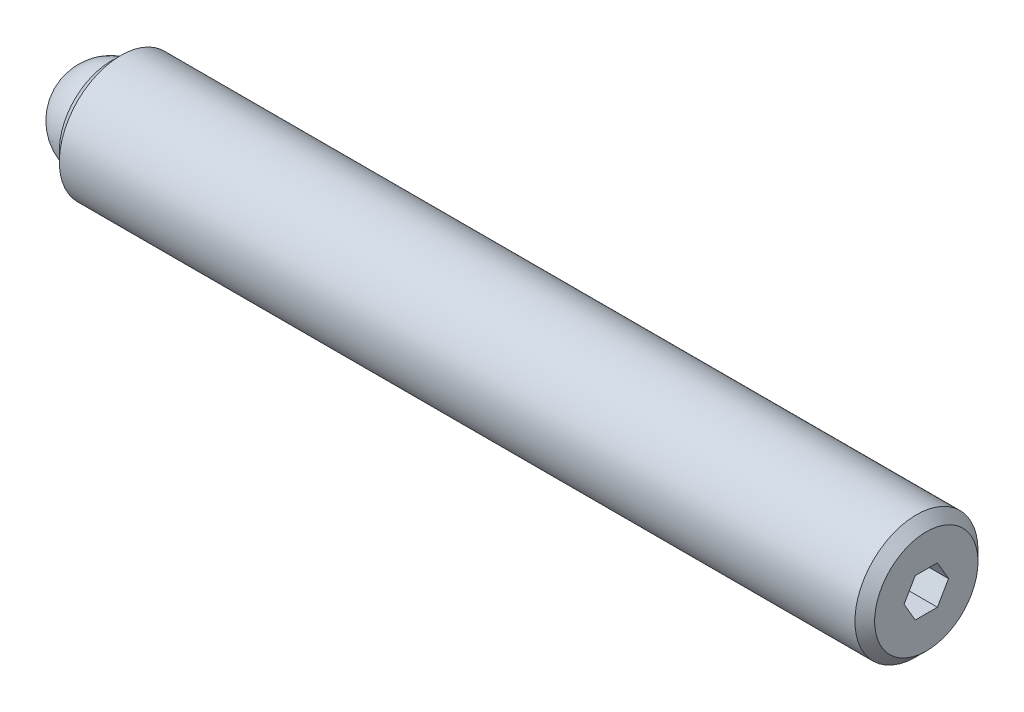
ISO-10303-21;
HEADER;
FILE_DESCRIPTION(('STEP AP214'),'2;1');
FILE_NAME('part.step','',(''),(''),'','','');
FILE_SCHEMA(('AUTOMOTIVE_DESIGN { 1 0 10303 214 1 1 1 1 }'));
ENDSEC;
DATA;
#1=APPLICATION_CONTEXT('core data for automotive mechanical design processes');
#2=APPLICATION_PROTOCOL_DEFINITION('international standard','automotive_design',2000,#1);
#3=PRODUCT_CONTEXT('',#1,'mechanical');
#4=PRODUCT('Part','Part','',(#3));
#5=PRODUCT_RELATED_PRODUCT_CATEGORY('part','',(#4));
#6=PRODUCT_DEFINITION_FORMATION('','',#4);
#7=PRODUCT_DEFINITION_CONTEXT('part definition',#1,'design');
#8=PRODUCT_DEFINITION('design','',#6,#7);
#9=PRODUCT_DEFINITION_SHAPE('','',#8);
#10=(LENGTH_UNIT() NAMED_UNIT(*) SI_UNIT(.MILLI.,.METRE.));
#11=(NAMED_UNIT(*) PLANE_ANGLE_UNIT() SI_UNIT($,.RADIAN.));
#12=(NAMED_UNIT(*) SI_UNIT($,.STERADIAN.) SOLID_ANGLE_UNIT());
#13=UNCERTAINTY_MEASURE_WITH_UNIT(LENGTH_MEASURE(1.E-05),#10,'distance_accuracy_value','');
#14=(GEOMETRIC_REPRESENTATION_CONTEXT(3) GLOBAL_UNCERTAINTY_ASSIGNED_CONTEXT((#13)) GLOBAL_UNIT_ASSIGNED_CONTEXT((#10,
#11,#12)) REPRESENTATION_CONTEXT('',''));
#15=CARTESIAN_POINT('',(0.,0.,0.));
#16=DIRECTION('',(0.,0.,1.));
#17=DIRECTION('',(1.,0.,0.));
#18=AXIS2_PLACEMENT_3D('',#15,#16,#17);
#19=CARTESIAN_POINT('',(0.,0.,0.));
#20=DIRECTION('',(0.,-1.,0.));
#21=DIRECTION('',(0.,0.,1.));
#22=AXIS2_PLACEMENT_3D('',#19,#20,#21);
#23=SPHERICAL_SURFACE('',#22,2.38125);
#24=CARTESIAN_POINT('',(0.,-2.38125,0.));
#25=VERTEX_POINT('',#24);
#26=VERTEX_LOOP('',#25);
#27=FACE_BOUND('',#26,.T.);
#28=ADVANCED_FACE('F41',(#27),#23,.T.);
#29=CLOSED_SHELL('',(#28));
#30=MANIFOLD_SOLID_BREP('B2',#29);
#31=CARTESIAN_POINT('',(42.06875,0.,0.));
#32=DIRECTION('',(-1.,0.,0.));
#33=DIRECTION('',(0.,0.,1.));
#34=AXIS2_PLACEMENT_3D('',#31,#32,#33);
#35=CYLINDRICAL_SURFACE('',#34,3.175);
#36=CARTESIAN_POINT('',(41.56075,0.,0.));
#37=DIRECTION('',(1.,0.,0.));
#38=DIRECTION('',(0.,0.,-1.));
#39=AXIS2_PLACEMENT_3D('',#36,#37,#38);
#40=CIRCLE('',#39,3.175);
#41=CARTESIAN_POINT('',(41.56075,0.,-3.175));
#42=VERTEX_POINT('',#41);
#43=EDGE_CURVE('E39',#42,#42,#40,.F.);
#44=ORIENTED_EDGE('',*,*,#43,.T.);
#45=EDGE_LOOP('',(#44));
#46=FACE_BOUND('',#45,.T.);
#47=CARTESIAN_POINT('',(0.508000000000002,0.,0.));
#48=DIRECTION('',(1.,0.,0.));
#49=DIRECTION('',(0.,0.,-1.));
#50=AXIS2_PLACEMENT_3D('',#47,#48,#49);
#51=CIRCLE('',#50,3.175);
#52=CARTESIAN_POINT('',(0.508000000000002,0.,-3.175));
#53=VERTEX_POINT('',#52);
#54=EDGE_CURVE('E176',#53,#53,#51,.T.);
#55=ORIENTED_EDGE('',*,*,#54,.T.);
#56=EDGE_LOOP('',(#55));
#57=FACE_BOUND('',#56,.T.);
#58=ADVANCED_FACE('F54',(#46,#57),#35,.T.);
#59=CARTESIAN_POINT('',(42.06875,0.,0.));
#60=DIRECTION('',(1.,0.,0.));
#61=DIRECTION('',(0.,0.,-1.));
#62=AXIS2_PLACEMENT_3D('',#59,#60,#61);
#63=PLANE('',#62);
#64=DIRECTION('',(0.,0.866025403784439,-0.5));
#65=VECTOR('',#64,1.);
#66=CARTESIAN_POINT('',(42.06875,-0.9921875,-0.572839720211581));
#67=LINE('',#66,#65);
#68=CARTESIAN_POINT('',(42.06875,-0.9921875,-0.572839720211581));
#69=VERTEX_POINT('',#68);
#70=CARTESIAN_POINT('',(42.06875,0.,-1.14567944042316));
#71=VERTEX_POINT('',#70);
#72=EDGE_CURVE('E77',#69,#71,#67,.T.);
#73=ORIENTED_EDGE('',*,*,#72,.F.);
#74=DIRECTION('',(0.,0.,-1.));
#75=VECTOR('',#74,1.);
#76=CARTESIAN_POINT('',(42.06875,-0.9921875,0.572839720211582));
#77=LINE('',#76,#75);
#78=CARTESIAN_POINT('',(42.06875,-0.9921875,0.572839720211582));
#79=VERTEX_POINT('',#78);
#80=EDGE_CURVE('E143',#79,#69,#77,.T.);
#81=ORIENTED_EDGE('',*,*,#80,.F.);
#82=DIRECTION('',(0.,-0.866025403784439,-0.5));
#83=VECTOR('',#82,1.);
#84=CARTESIAN_POINT('',(42.06875,0.,1.14567944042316));
#85=LINE('',#84,#83);
#86=CARTESIAN_POINT('',(42.06875,0.,1.14567944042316));
#87=VERTEX_POINT('',#86);
#88=EDGE_CURVE('E169',#87,#79,#85,.T.);
#89=ORIENTED_EDGE('',*,*,#88,.F.);
#90=DIRECTION('',(0.,-0.866025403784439,0.5));
#91=VECTOR('',#90,1.);
#92=CARTESIAN_POINT('',(42.06875,0.992187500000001,0.572839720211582));
#93=LINE('',#92,#91);
#94=CARTESIAN_POINT('',(42.06875,0.992187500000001,0.572839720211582));
#95=VERTEX_POINT('',#94);
#96=EDGE_CURVE('E166',#95,#87,#93,.T.);
#97=ORIENTED_EDGE('',*,*,#96,.F.);
#98=DIRECTION('',(0.,0.,1.));
#99=VECTOR('',#98,1.);
#100=CARTESIAN_POINT('',(42.06875,0.9921875,-0.572839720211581));
#101=LINE('',#100,#99);
#102=CARTESIAN_POINT('',(42.06875,0.9921875,-0.572839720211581));
#103=VERTEX_POINT('',#102);
#104=EDGE_CURVE('E163',#103,#95,#101,.T.);
#105=ORIENTED_EDGE('',*,*,#104,.F.);
#106=DIRECTION('',(0.,0.866025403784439,0.5));
#107=VECTOR('',#106,1.);
#108=CARTESIAN_POINT('',(42.06875,0.,-1.14567944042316));
#109=LINE('',#108,#107);
#110=EDGE_CURVE('E160',#71,#103,#109,.T.);
#111=ORIENTED_EDGE('',*,*,#110,.F.);
#112=EDGE_LOOP('',(#73,#81,#89,#97,#105,#111));
#113=FACE_BOUND('',#112,.T.);
#114=CARTESIAN_POINT('',(42.06875,0.,0.));
#115=DIRECTION('',(1.,0.,0.));
#116=DIRECTION('',(0.,0.,-1.));
#117=AXIS2_PLACEMENT_3D('',#114,#115,#116);
#118=CIRCLE('',#117,2.667);
#119=CARTESIAN_POINT('',(42.06875,0.,-2.667));
#120=VERTEX_POINT('',#119);
#121=EDGE_CURVE('E62',#120,#120,#118,.T.);
#122=ORIENTED_EDGE('',*,*,#121,.T.);
#123=EDGE_LOOP('',(#122));
#124=FACE_BOUND('',#123,.T.);
#125=ADVANCED_FACE('F193',(#113,#124),#63,.T.);
#126=CARTESIAN_POINT('',(0.,0.,0.));
#127=DIRECTION('',(1.,0.,0.));
#128=DIRECTION('',(0.,0.,-1.));
#129=AXIS2_PLACEMENT_3D('',#126,#127,#128);
#130=PLANE('',#129);
#131=CARTESIAN_POINT('',(0.,0.,0.));
#132=DIRECTION('',(-1.,0.,0.));
#133=DIRECTION('',(0.,0.,1.));
#134=AXIS2_PLACEMENT_3D('',#131,#132,#133);
#135=CIRCLE('',#134,2.38125);
#136=CARTESIAN_POINT('',(0.,2.38040333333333,-0.0634943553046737));
#137=VERTEX_POINT('',#136);
#138=CARTESIAN_POINT('',(0.,2.38040333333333,0.0634943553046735));
#139=VERTEX_POINT('',#138);
#140=EDGE_CURVE('E128',#137,#139,#135,.T.);
#141=ORIENTED_EDGE('',*,*,#140,.F.);
#142=CARTESIAN_POINT('',(0.,2.38125,0.));
#143=DIRECTION('',(-1.,0.,0.));
#144=DIRECTION('',(0.,0.,1.));
#145=AXIS2_PLACEMENT_3D('',#142,#143,#144);
#146=CIRCLE('',#145,0.0635000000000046);
#147=EDGE_CURVE('E117',#139,#137,#146,.T.);
#148=ORIENTED_EDGE('',*,*,#147,.F.);
#149=EDGE_LOOP('',(#141,#148));
#150=FACE_BOUND('',#149,.T.);
#151=CARTESIAN_POINT('',(0.,0.,0.));
#152=DIRECTION('',(1.,0.,0.));
#153=DIRECTION('',(0.,0.,-1.));
#154=AXIS2_PLACEMENT_3D('',#151,#152,#153);
#155=CIRCLE('',#154,2.66699999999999);
#156=CARTESIAN_POINT('',(0.,0.,-2.66699999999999));
#157=VERTEX_POINT('',#156);
#158=EDGE_CURVE('E188',#157,#157,#155,.F.);
#159=ORIENTED_EDGE('',*,*,#158,.T.);
#160=EDGE_LOOP('',(#159));
#161=FACE_BOUND('',#160,.T.);
#162=ADVANCED_FACE('F132',(#150,#161),#130,.F.);
#163=CARTESIAN_POINT('',(0.508000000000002,0.,0.));
#164=DIRECTION('',(1.,0.,0.));
#165=DIRECTION('',(0.,0.,-1.));
#166=AXIS2_PLACEMENT_3D('',#163,#164,#165);
#167=CONICAL_SURFACE('',#166,3.175,0.785398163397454);
#168=ORIENTED_EDGE('',*,*,#158,.F.);
#169=EDGE_LOOP('',(#168));
#170=FACE_BOUND('',#169,.T.);
#171=ORIENTED_EDGE('',*,*,#54,.F.);
#172=EDGE_LOOP('',(#171));
#173=FACE_BOUND('',#172,.T.);
#174=ADVANCED_FACE('F197',(#170,#173),#167,.T.);
#175=CARTESIAN_POINT('',(42.06875,0.,0.));
#176=DIRECTION('',(-1.,0.,0.));
#177=DIRECTION('',(0.,0.,1.));
#178=AXIS2_PLACEMENT_3D('',#175,#176,#177);
#179=CONICAL_SURFACE('',#178,2.667,0.785398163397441);
#180=ORIENTED_EDGE('',*,*,#43,.F.);
#181=EDGE_LOOP('',(#180));
#182=FACE_BOUND('',#181,.T.);
#183=ORIENTED_EDGE('',*,*,#121,.F.);
#184=EDGE_LOOP('',(#183));
#185=FACE_BOUND('',#184,.T.);
#186=ADVANCED_FACE('F56',(#182,#185),#179,.T.);
#187=CARTESIAN_POINT('',(39.78275,-0.9921875,-0.572839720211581));
#188=DIRECTION('',(0.,-0.5,-0.866025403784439));
#189=DIRECTION('',(0.,0.866025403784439,-0.5));
#190=AXIS2_PLACEMENT_3D('',#187,#188,#189);
#191=PLANE('',#190);
#192=ORIENTED_EDGE('',*,*,#72,.T.);
#193=DIRECTION('',(1.,0.,0.));
#194=VECTOR('',#193,1.);
#195=CARTESIAN_POINT('',(39.78275,0.,-1.14567944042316));
#196=LINE('',#195,#194);
#197=CARTESIAN_POINT('',(39.78275,0.,-1.14567944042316));
#198=VERTEX_POINT('',#197);
#199=EDGE_CURVE('E158',#198,#71,#196,.T.);
#200=ORIENTED_EDGE('',*,*,#199,.F.);
#201=DIRECTION('',(0.,0.866025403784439,-0.5));
#202=VECTOR('',#201,1.);
#203=CARTESIAN_POINT('',(39.78275,-0.9921875,-0.572839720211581));
#204=LINE('',#203,#202);
#205=CARTESIAN_POINT('',(39.78275,-0.9921875,-0.572839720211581));
#206=VERTEX_POINT('',#205);
#207=EDGE_CURVE('E139',#206,#198,#204,.T.);
#208=ORIENTED_EDGE('',*,*,#207,.F.);
#209=DIRECTION('',(1.,0.,0.));
#210=VECTOR('',#209,1.);
#211=CARTESIAN_POINT('',(39.78275,-0.9921875,-0.572839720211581));
#212=LINE('',#211,#210);
#213=EDGE_CURVE('E174',#206,#69,#212,.T.);
#214=ORIENTED_EDGE('',*,*,#213,.T.);
#215=EDGE_LOOP('',(#192,#200,#208,#214));
#216=FACE_BOUND('',#215,.T.);
#217=ADVANCED_FACE('F196',(#216),#191,.F.);
#218=CARTESIAN_POINT('',(39.78275,-0.9921875,0.572839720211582));
#219=DIRECTION('',(0.,-1.,0.));
#220=DIRECTION('',(0.,0.,-1.));
#221=AXIS2_PLACEMENT_3D('',#218,#219,#220);
#222=PLANE('',#221);
#223=ORIENTED_EDGE('',*,*,#80,.T.);
#224=ORIENTED_EDGE('',*,*,#213,.F.);
#225=DIRECTION('',(0.,0.,-1.));
#226=VECTOR('',#225,1.);
#227=CARTESIAN_POINT('',(39.78275,-0.9921875,0.572839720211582));
#228=LINE('',#227,#226);
#229=CARTESIAN_POINT('',(39.78275,-0.9921875,0.572839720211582));
#230=VERTEX_POINT('',#229);
#231=EDGE_CURVE('E155',#230,#206,#228,.T.);
#232=ORIENTED_EDGE('',*,*,#231,.F.);
#233=DIRECTION('',(1.,0.,0.));
#234=VECTOR('',#233,1.);
#235=CARTESIAN_POINT('',(39.78275,-0.9921875,0.572839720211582));
#236=LINE('',#235,#234);
#237=EDGE_CURVE('E177',#230,#79,#236,.T.);
#238=ORIENTED_EDGE('',*,*,#237,.T.);
#239=EDGE_LOOP('',(#223,#224,#232,#238));
#240=FACE_BOUND('',#239,.T.);
#241=ADVANCED_FACE('F203',(#240),#222,.F.);
#242=CARTESIAN_POINT('',(39.78275,0.,1.14567944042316));
#243=DIRECTION('',(0.,-0.5,0.866025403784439));
#244=DIRECTION('',(0.,-0.866025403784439,-0.5));
#245=AXIS2_PLACEMENT_3D('',#242,#243,#244);
#246=PLANE('',#245);
#247=ORIENTED_EDGE('',*,*,#88,.T.);
#248=ORIENTED_EDGE('',*,*,#237,.F.);
#249=DIRECTION('',(0.,-0.866025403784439,-0.5));
#250=VECTOR('',#249,1.);
#251=CARTESIAN_POINT('',(39.78275,0.,1.14567944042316));
#252=LINE('',#251,#250);
#253=CARTESIAN_POINT('',(39.78275,0.,1.14567944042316));
#254=VERTEX_POINT('',#253);
#255=EDGE_CURVE('E152',#254,#230,#252,.T.);
#256=ORIENTED_EDGE('',*,*,#255,.F.);
#257=DIRECTION('',(1.,0.,0.));
#258=VECTOR('',#257,1.);
#259=CARTESIAN_POINT('',(39.78275,0.,1.14567944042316));
#260=LINE('',#259,#258);
#261=EDGE_CURVE('E179',#254,#87,#260,.T.);
#262=ORIENTED_EDGE('',*,*,#261,.T.);
#263=EDGE_LOOP('',(#247,#248,#256,#262));
#264=FACE_BOUND('',#263,.T.);
#265=ADVANCED_FACE('F231',(#264),#246,.F.);
#266=CARTESIAN_POINT('',(39.78275,0.992187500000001,0.572839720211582));
#267=DIRECTION('',(0.,0.5,0.866025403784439));
#268=DIRECTION('',(0.,-0.866025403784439,0.5));
#269=AXIS2_PLACEMENT_3D('',#266,#267,#268);
#270=PLANE('',#269);
#271=ORIENTED_EDGE('',*,*,#96,.T.);
#272=ORIENTED_EDGE('',*,*,#261,.F.);
#273=DIRECTION('',(0.,-0.866025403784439,0.5));
#274=VECTOR('',#273,1.);
#275=CARTESIAN_POINT('',(39.78275,0.992187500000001,0.572839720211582));
#276=LINE('',#275,#274);
#277=CARTESIAN_POINT('',(39.78275,0.992187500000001,0.572839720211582));
#278=VERTEX_POINT('',#277);
#279=EDGE_CURVE('E149',#278,#254,#276,.T.);
#280=ORIENTED_EDGE('',*,*,#279,.F.);
#281=DIRECTION('',(1.,0.,0.));
#282=VECTOR('',#281,1.);
#283=CARTESIAN_POINT('',(39.78275,0.992187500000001,0.572839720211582));
#284=LINE('',#283,#282);
#285=EDGE_CURVE('E181',#278,#95,#284,.T.);
#286=ORIENTED_EDGE('',*,*,#285,.T.);
#287=EDGE_LOOP('',(#271,#272,#280,#286));
#288=FACE_BOUND('',#287,.T.);
#289=ADVANCED_FACE('F227',(#288),#270,.F.);
#290=CARTESIAN_POINT('',(39.78275,0.9921875,-0.572839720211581));
#291=DIRECTION('',(0.,1.,0.));
#292=DIRECTION('',(0.,0.,1.));
#293=AXIS2_PLACEMENT_3D('',#290,#291,#292);
#294=PLANE('',#293);
#295=ORIENTED_EDGE('',*,*,#104,.T.);
#296=ORIENTED_EDGE('',*,*,#285,.F.);
#297=DIRECTION('',(0.,0.,1.));
#298=VECTOR('',#297,1.);
#299=CARTESIAN_POINT('',(39.78275,0.9921875,-0.572839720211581));
#300=LINE('',#299,#298);
#301=CARTESIAN_POINT('',(39.78275,0.9921875,-0.572839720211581));
#302=VERTEX_POINT('',#301);
#303=EDGE_CURVE('E146',#302,#278,#300,.T.);
#304=ORIENTED_EDGE('',*,*,#303,.F.);
#305=DIRECTION('',(1.,0.,0.));
#306=VECTOR('',#305,1.);
#307=CARTESIAN_POINT('',(39.78275,0.9921875,-0.572839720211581));
#308=LINE('',#307,#306);
#309=EDGE_CURVE('E183',#302,#103,#308,.T.);
#310=ORIENTED_EDGE('',*,*,#309,.T.);
#311=EDGE_LOOP('',(#295,#296,#304,#310));
#312=FACE_BOUND('',#311,.T.);
#313=ADVANCED_FACE('F223',(#312),#294,.F.);
#314=CARTESIAN_POINT('',(39.78275,0.,-1.14567944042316));
#315=DIRECTION('',(0.,0.5,-0.866025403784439));
#316=DIRECTION('',(0.,0.866025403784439,0.5));
#317=AXIS2_PLACEMENT_3D('',#314,#315,#316);
#318=PLANE('',#317);
#319=ORIENTED_EDGE('',*,*,#110,.T.);
#320=ORIENTED_EDGE('',*,*,#309,.F.);
#321=DIRECTION('',(0.,0.866025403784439,0.5));
#322=VECTOR('',#321,1.);
#323=CARTESIAN_POINT('',(39.78275,0.,-1.14567944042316));
#324=LINE('',#323,#322);
#325=EDGE_CURVE('E142',#198,#302,#324,.T.);
#326=ORIENTED_EDGE('',*,*,#325,.F.);
#327=ORIENTED_EDGE('',*,*,#199,.T.);
#328=EDGE_LOOP('',(#319,#320,#326,#327));
#329=FACE_BOUND('',#328,.T.);
#330=ADVANCED_FACE('F219',(#329),#318,.F.);
#331=CARTESIAN_POINT('',(39.78275,0.,0.));
#332=DIRECTION('',(1.,0.,0.));
#333=DIRECTION('',(0.,0.,-1.));
#334=AXIS2_PLACEMENT_3D('',#331,#332,#333);
#335=PLANE('',#334);
#336=ORIENTED_EDGE('',*,*,#207,.T.);
#337=ORIENTED_EDGE('',*,*,#325,.T.);
#338=ORIENTED_EDGE('',*,*,#303,.T.);
#339=ORIENTED_EDGE('',*,*,#279,.T.);
#340=ORIENTED_EDGE('',*,*,#255,.T.);
#341=ORIENTED_EDGE('',*,*,#231,.T.);
#342=EDGE_LOOP('',(#336,#337,#338,#339,#340,#341));
#343=FACE_BOUND('',#342,.T.);
#344=ADVANCED_FACE('F222',(#343),#335,.T.);
#345=CARTESIAN_POINT('',(2.38125,0.,0.));
#346=DIRECTION('',(-1.,0.,0.));
#347=DIRECTION('',(0.,0.,1.));
#348=AXIS2_PLACEMENT_3D('',#345,#346,#347);
#349=CYLINDRICAL_SURFACE('',#348,2.38125);
#350=CARTESIAN_POINT('',(2.38125,0.,0.));
#351=DIRECTION('',(-1.,0.,0.));
#352=DIRECTION('',(0.,0.,1.));
#353=AXIS2_PLACEMENT_3D('',#350,#351,#352);
#354=CIRCLE('',#353,2.38125);
#355=CARTESIAN_POINT('',(2.38125,2.38040333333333,-0.0634943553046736));
#356=VERTEX_POINT('',#355);
#357=CARTESIAN_POINT('',(2.38125,2.38040333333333,0.0634943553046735));
#358=VERTEX_POINT('',#357);
#359=EDGE_CURVE('E130',#356,#358,#354,.T.);
#360=ORIENTED_EDGE('',*,*,#359,.F.);
#361=DIRECTION('',(-1.,0.,0.));
#362=VECTOR('',#361,1.);
#363=CARTESIAN_POINT('',(2.52362097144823,2.38040333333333,-0.0634943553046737));
#364=LINE('',#363,#362);
#365=EDGE_CURVE('E69',#356,#137,#364,.T.);
#366=ORIENTED_EDGE('',*,*,#365,.T.);
#367=ORIENTED_EDGE('',*,*,#140,.T.);
#368=DIRECTION('',(-1.,0.,0.));
#369=VECTOR('',#368,1.);
#370=CARTESIAN_POINT('',(2.52362097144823,2.38040333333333,0.0634943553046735));
#371=LINE('',#370,#369);
#372=EDGE_CURVE('E120',#358,#139,#371,.T.);
#373=ORIENTED_EDGE('',*,*,#372,.F.);
#374=EDGE_LOOP('',(#360,#366,#367,#373));
#375=FACE_BOUND('',#374,.T.);
#376=ADVANCED_FACE('F127',(#375),#349,.F.);
#377=CARTESIAN_POINT('',(2.38125,0.,0.));
#378=DIRECTION('',(-1.,0.,0.));
#379=DIRECTION('',(0.,0.,1.));
#380=AXIS2_PLACEMENT_3D('',#377,#378,#379);
#381=PLANE('',#380);
#382=ORIENTED_EDGE('',*,*,#359,.T.);
#383=CARTESIAN_POINT('',(2.38125,2.38125,0.));
#384=DIRECTION('',(-1.,0.,0.));
#385=DIRECTION('',(0.,0.,1.));
#386=AXIS2_PLACEMENT_3D('',#383,#384,#385);
#387=CIRCLE('',#386,0.0635000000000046);
#388=EDGE_CURVE('E134',#356,#358,#387,.F.);
#389=ORIENTED_EDGE('',*,*,#388,.F.);
#390=EDGE_LOOP('',(#382,#389));
#391=FACE_BOUND('',#390,.T.);
#392=ADVANCED_FACE('F244',(#391),#381,.T.);
#393=CARTESIAN_POINT('',(2.52362097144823,2.38125,0.));
#394=DIRECTION('',(-1.,0.,0.));
#395=DIRECTION('',(0.,0.,1.));
#396=AXIS2_PLACEMENT_3D('',#393,#394,#395);
#397=CYLINDRICAL_SURFACE('',#396,0.0635000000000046);
#398=ORIENTED_EDGE('',*,*,#388,.T.);
#399=ORIENTED_EDGE('',*,*,#372,.T.);
#400=ORIENTED_EDGE('',*,*,#147,.T.);
#401=ORIENTED_EDGE('',*,*,#365,.F.);
#402=EDGE_LOOP('',(#398,#399,#400,#401));
#403=FACE_BOUND('',#402,.T.);
#404=ADVANCED_FACE('F118',(#403),#397,.F.);
#405=CLOSED_SHELL('',(#58,#125,#162,#174,#186,#217,#241,#265,#289,#313,#330,#344,#376,#392,#404));
#406=MANIFOLD_SOLID_BREP('B6',#405);
#407=ADVANCED_BREP_SHAPE_REPRESENTATION('',(#18,#30,#406),#14);
#408=SHAPE_DEFINITION_REPRESENTATION(#9,#407);
ENDSEC;
END-ISO-10303-21;
